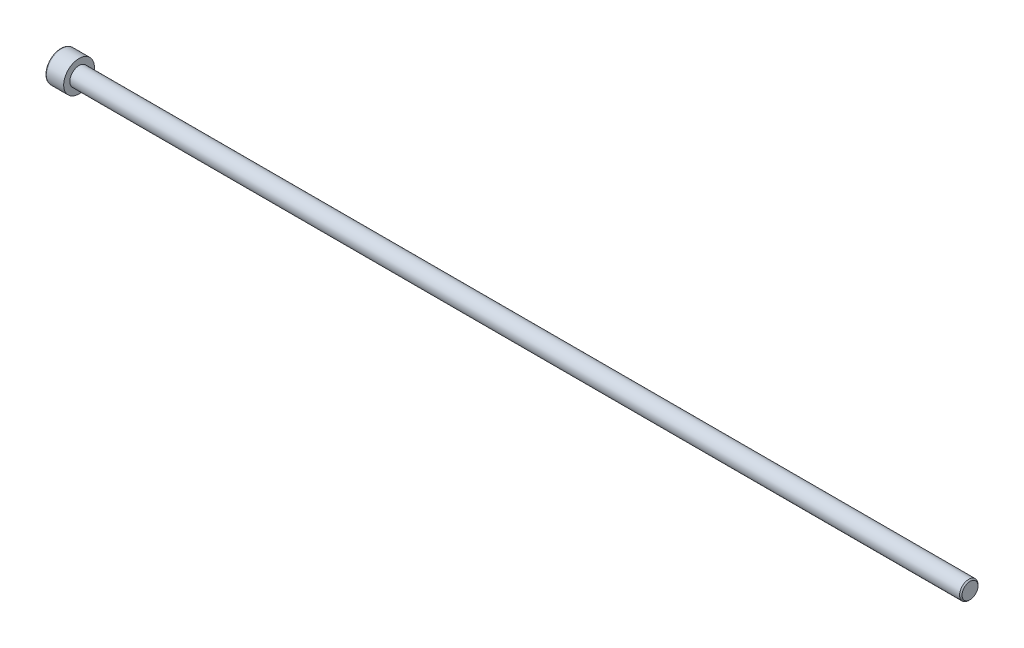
ISO-10303-21;
HEADER;
FILE_DESCRIPTION(('STEP AP214'),'2;1');
FILE_NAME('part.step','',(''),(''),'','','');
FILE_SCHEMA(('AUTOMOTIVE_DESIGN { 1 0 10303 214 1 1 1 1 }'));
ENDSEC;
DATA;
#1=APPLICATION_CONTEXT('core data for automotive mechanical design processes');
#2=APPLICATION_PROTOCOL_DEFINITION('international standard','automotive_design',2000,#1);
#3=PRODUCT_CONTEXT('',#1,'mechanical');
#4=PRODUCT('Part','Part','',(#3));
#5=PRODUCT_RELATED_PRODUCT_CATEGORY('part','',(#4));
#6=PRODUCT_DEFINITION_FORMATION('','',#4);
#7=PRODUCT_DEFINITION_CONTEXT('part definition',#1,'design');
#8=PRODUCT_DEFINITION('design','',#6,#7);
#9=PRODUCT_DEFINITION_SHAPE('','',#8);
#10=(LENGTH_UNIT() NAMED_UNIT(*) SI_UNIT(.MILLI.,.METRE.));
#11=(NAMED_UNIT(*) PLANE_ANGLE_UNIT() SI_UNIT($,.RADIAN.));
#12=(NAMED_UNIT(*) SI_UNIT($,.STERADIAN.) SOLID_ANGLE_UNIT());
#13=UNCERTAINTY_MEASURE_WITH_UNIT(LENGTH_MEASURE(1.E-05),#10,'distance_accuracy_value','');
#14=(GEOMETRIC_REPRESENTATION_CONTEXT(3) GLOBAL_UNCERTAINTY_ASSIGNED_CONTEXT((#13)) GLOBAL_UNIT_ASSIGNED_CONTEXT((#10,
#11,#12)) REPRESENTATION_CONTEXT('',''));
#15=CARTESIAN_POINT('',(0.,0.,0.));
#16=DIRECTION('',(0.,0.,1.));
#17=DIRECTION('',(1.,0.,0.));
#18=AXIS2_PLACEMENT_3D('',#15,#16,#17);
#19=CARTESIAN_POINT('',(0.,0.,0.));
#20=DIRECTION('',(1.,0.,0.));
#21=DIRECTION('',(0.,0.,-1.));
#22=AXIS2_PLACEMENT_3D('',#19,#20,#21);
#23=PLANE('',#22);
#24=CARTESIAN_POINT('',(0.,0.,0.));
#25=DIRECTION('',(1.,0.,0.));
#26=DIRECTION('',(0.,0.,-1.));
#27=AXIS2_PLACEMENT_3D('',#24,#25,#26);
#28=CIRCLE('',#27,5.);
#29=CARTESIAN_POINT('',(0.,0.,-5.));
#30=VERTEX_POINT('',#29);
#31=EDGE_CURVE('E225',#30,#30,#28,.T.);
#32=ORIENTED_EDGE('',*,*,#31,.T.);
#33=EDGE_LOOP('',(#32));
#34=FACE_BOUND('',#33,.T.);
#35=CARTESIAN_POINT('',(0.,0.,0.));
#36=DIRECTION('',(1.,0.,0.));
#37=DIRECTION('',(0.,0.,-1.));
#38=AXIS2_PLACEMENT_3D('',#35,#36,#37);
#39=CIRCLE('',#38,3.);
#40=CARTESIAN_POINT('',(0.,0.,-3.));
#41=VERTEX_POINT('',#40);
#42=EDGE_CURVE('E222',#41,#41,#39,.T.);
#43=ORIENTED_EDGE('',*,*,#42,.F.);
#44=EDGE_LOOP('',(#43));
#45=FACE_BOUND('',#44,.T.);
#46=ADVANCED_FACE('F17',(#34,#45),#23,.T.);
#47=CARTESIAN_POINT('',(-6.,0.,0.));
#48=DIRECTION('',(1.,0.,0.));
#49=DIRECTION('',(0.,0.,-1.));
#50=AXIS2_PLACEMENT_3D('',#47,#48,#49);
#51=CYLINDRICAL_SURFACE('',#50,5.);
#52=CARTESIAN_POINT('',(-5.6,0.,0.));
#53=DIRECTION('',(1.,0.,0.));
#54=DIRECTION('',(0.,0.,-1.));
#55=AXIS2_PLACEMENT_3D('',#52,#53,#54);
#56=CIRCLE('',#55,5.);
#57=CARTESIAN_POINT('',(-5.6,0.,-5.));
#58=VERTEX_POINT('',#57);
#59=EDGE_CURVE('E233',#58,#58,#56,.T.);
#60=ORIENTED_EDGE('',*,*,#59,.T.);
#61=EDGE_LOOP('',(#60));
#62=FACE_BOUND('',#61,.T.);
#63=ORIENTED_EDGE('',*,*,#31,.F.);
#64=EDGE_LOOP('',(#63));
#65=FACE_BOUND('',#64,.T.);
#66=ADVANCED_FACE('F19',(#62,#65),#51,.T.);
#67=CARTESIAN_POINT('',(-6.,0.,0.));
#68=DIRECTION('',(1.,0.,0.));
#69=DIRECTION('',(0.,0.,-1.));
#70=AXIS2_PLACEMENT_3D('',#67,#68,#69);
#71=PLANE('',#70);
#72=CARTESIAN_POINT('',(-6.,0.,0.));
#73=DIRECTION('',(1.,0.,0.));
#74=DIRECTION('',(0.,0.,-1.));
#75=AXIS2_PLACEMENT_3D('',#72,#73,#74);
#76=CIRCLE('',#75,4.6);
#77=CARTESIAN_POINT('',(-6.,0.,-4.6));
#78=VERTEX_POINT('',#77);
#79=EDGE_CURVE('E30',#78,#78,#76,.F.);
#80=ORIENTED_EDGE('',*,*,#79,.T.);
#81=EDGE_LOOP('',(#80));
#82=FACE_BOUND('',#81,.T.);
#83=CARTESIAN_POINT('',(-6.,0.,0.));
#84=DIRECTION('',(-1.,0.,0.));
#85=DIRECTION('',(0.,0.,1.));
#86=AXIS2_PLACEMENT_3D('',#83,#84,#85);
#87=CIRCLE('',#86,2.88675134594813);
#88=CARTESIAN_POINT('',(-6.,1.44337567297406,-2.5));
#89=VERTEX_POINT('',#88);
#90=CARTESIAN_POINT('',(-6.,-1.44337567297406,-2.5));
#91=VERTEX_POINT('',#90);
#92=EDGE_CURVE('E186',#89,#91,#87,.T.);
#93=ORIENTED_EDGE('',*,*,#92,.F.);
#94=CARTESIAN_POINT('',(-6.,2.88675134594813,0.));
#95=VERTEX_POINT('',#94);
#96=EDGE_CURVE('E91',#95,#89,#87,.T.);
#97=ORIENTED_EDGE('',*,*,#96,.F.);
#98=CARTESIAN_POINT('',(-6.,1.44337567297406,2.5));
#99=VERTEX_POINT('',#98);
#100=EDGE_CURVE('E36',#99,#95,#87,.T.);
#101=ORIENTED_EDGE('',*,*,#100,.F.);
#102=CARTESIAN_POINT('',(-6.,-1.44337567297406,2.5));
#103=VERTEX_POINT('',#102);
#104=EDGE_CURVE('E43',#103,#99,#87,.T.);
#105=ORIENTED_EDGE('',*,*,#104,.F.);
#106=CARTESIAN_POINT('',(-6.,-2.88675134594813,0.));
#107=VERTEX_POINT('',#106);
#108=EDGE_CURVE('E87',#107,#103,#87,.T.);
#109=ORIENTED_EDGE('',*,*,#108,.F.);
#110=EDGE_CURVE('E189',#91,#107,#87,.T.);
#111=ORIENTED_EDGE('',*,*,#110,.F.);
#112=EDGE_LOOP('',(#93,#97,#101,#105,#109,#111));
#113=FACE_BOUND('',#112,.T.);
#114=ADVANCED_FACE('F165',(#82,#113),#71,.F.);
#115=CARTESIAN_POINT('',(290.,0.,0.));
#116=DIRECTION('',(-1.,0.,0.));
#117=DIRECTION('',(0.,0.,1.));
#118=AXIS2_PLACEMENT_3D('',#115,#116,#117);
#119=CYLINDRICAL_SURFACE('',#118,3.);
#120=CARTESIAN_POINT('',(289.6,0.,0.));
#121=DIRECTION('',(1.,0.,0.));
#122=DIRECTION('',(0.,0.,-1.));
#123=AXIS2_PLACEMENT_3D('',#120,#121,#122);
#124=CIRCLE('',#123,3.);
#125=CARTESIAN_POINT('',(289.6,0.,-3.));
#126=VERTEX_POINT('',#125);
#127=EDGE_CURVE('E230',#126,#126,#124,.F.);
#128=ORIENTED_EDGE('',*,*,#127,.T.);
#129=EDGE_LOOP('',(#128));
#130=FACE_BOUND('',#129,.T.);
#131=ORIENTED_EDGE('',*,*,#42,.T.);
#132=EDGE_LOOP('',(#131));
#133=FACE_BOUND('',#132,.T.);
#134=ADVANCED_FACE('F170',(#130,#133),#119,.T.);
#135=CARTESIAN_POINT('',(290.,0.,0.));
#136=DIRECTION('',(1.,0.,0.));
#137=DIRECTION('',(0.,0.,-1.));
#138=AXIS2_PLACEMENT_3D('',#135,#136,#137);
#139=PLANE('',#138);
#140=CARTESIAN_POINT('',(290.,0.,0.));
#141=DIRECTION('',(1.,0.,0.));
#142=DIRECTION('',(0.,0.,-1.));
#143=AXIS2_PLACEMENT_3D('',#140,#141,#142);
#144=CIRCLE('',#143,2.6);
#145=CARTESIAN_POINT('',(290.,0.,-2.6));
#146=VERTEX_POINT('',#145);
#147=EDGE_CURVE('E227',#146,#146,#144,.T.);
#148=ORIENTED_EDGE('',*,*,#147,.T.);
#149=EDGE_LOOP('',(#148));
#150=FACE_BOUND('',#149,.T.);
#151=ADVANCED_FACE('F177',(#150),#139,.T.);
#152=CARTESIAN_POINT('',(290.,0.,0.));
#153=DIRECTION('',(-1.,0.,0.));
#154=DIRECTION('',(0.,0.,1.));
#155=AXIS2_PLACEMENT_3D('',#152,#153,#154);
#156=CONICAL_SURFACE('',#155,2.6,0.785398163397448);
#157=ORIENTED_EDGE('',*,*,#127,.F.);
#158=EDGE_LOOP('',(#157));
#159=FACE_BOUND('',#158,.T.);
#160=ORIENTED_EDGE('',*,*,#147,.F.);
#161=EDGE_LOOP('',(#160));
#162=FACE_BOUND('',#161,.T.);
#163=ADVANCED_FACE('F239',(#159,#162),#156,.T.);
#164=CARTESIAN_POINT('',(-5.6,0.,0.));
#165=DIRECTION('',(1.,0.,0.));
#166=DIRECTION('',(0.,0.,-1.));
#167=AXIS2_PLACEMENT_3D('',#164,#165,#166);
#168=TOROIDAL_SURFACE('',#167,4.6,0.4);
#169=ORIENTED_EDGE('',*,*,#79,.F.);
#170=EDGE_LOOP('',(#169));
#171=FACE_BOUND('',#170,.T.);
#172=ORIENTED_EDGE('',*,*,#59,.F.);
#173=EDGE_LOOP('',(#172));
#174=FACE_BOUND('',#173,.T.);
#175=ADVANCED_FACE('F115',(#171,#174),#168,.T.);
#176=CARTESIAN_POINT('',(-6.,0.,0.));
#177=DIRECTION('',(-1.,0.,0.));
#178=DIRECTION('',(0.,0.,1.));
#179=AXIS2_PLACEMENT_3D('',#176,#177,#178);
#180=CONICAL_SURFACE('',#179,2.88675134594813,0.785398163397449);
#181=ORIENTED_EDGE('',*,*,#92,.T.);
#182=CARTESIAN_POINT('',(-6.84474007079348,-2.77020363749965,-2.5));
#183=CARTESIAN_POINT('',(-6.79429722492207,-2.70224105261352,-2.5));
#184=CARTESIAN_POINT('',(-6.74437428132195,-2.63388631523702,-2.5));
#185=CARTESIAN_POINT('',(-6.6457965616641,-2.49624219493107,-2.5));
#186=CARTESIAN_POINT('',(-6.59714212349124,-2.42695257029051,-2.5));
#187=CARTESIAN_POINT('',(-6.50098521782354,-2.28678261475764,-2.5));
#188=CARTESIAN_POINT('',(-6.45349461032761,-2.21589411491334,-2.5));
#189=CARTESIAN_POINT('',(-6.36039504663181,-2.07289801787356,-2.5));
#190=CARTESIAN_POINT('',(-6.31478595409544,-2.00079050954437,-2.5));
#191=CARTESIAN_POINT('',(-6.22353453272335,-1.85136748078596,-2.5));
#192=CARTESIAN_POINT('',(-6.17801448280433,-1.77397645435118,-2.5));
#193=CARTESIAN_POINT('',(-6.09013743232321,-1.61742301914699,-2.5));
#194=CARTESIAN_POINT('',(-6.04778097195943,-1.53826031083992,-2.5));
#195=CARTESIAN_POINT('',(-5.92683684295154,-1.29823189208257,-2.5));
#196=CARTESIAN_POINT('',(-5.85401661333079,-1.1342610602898,-2.5));
#197=CARTESIAN_POINT('',(-5.76496495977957,-0.887111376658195,-2.5));
#198=CARTESIAN_POINT('',(-5.73923498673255,-0.807344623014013,-2.5));
#199=CARTESIAN_POINT('',(-5.69419468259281,-0.645977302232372,-2.5));
#200=CARTESIAN_POINT('',(-5.67488482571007,-0.564376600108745,-2.5));
#201=CARTESIAN_POINT('',(-5.64398238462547,-0.401145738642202,-2.5));
#202=CARTESIAN_POINT('',(-5.63226395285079,-0.319539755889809,-2.5));
#203=CARTESIAN_POINT('',(-5.61675591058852,-0.155573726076,-2.5));
#204=CARTESIAN_POINT('',(-5.61296514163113,-0.0732137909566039,-2.5));
#205=CARTESIAN_POINT('',(-5.61355627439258,0.0889406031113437,-2.5));
#206=CARTESIAN_POINT('',(-5.61769048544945,0.168736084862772,-2.5));
#207=CARTESIAN_POINT('',(-5.63338028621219,0.327588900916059,-2.5));
#208=CARTESIAN_POINT('',(-5.64493662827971,0.40664615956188,-2.5));
#209=CARTESIAN_POINT('',(-5.67505484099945,0.564788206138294,-2.5));
#210=CARTESIAN_POINT('',(-5.69373233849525,0.643850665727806,-2.5));
#211=CARTESIAN_POINT('',(-5.73713308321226,0.800257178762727,-2.5));
#212=CARTESIAN_POINT('',(-5.76185569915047,0.877601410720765,-2.5));
#213=CARTESIAN_POINT('',(-5.8505231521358,1.12635295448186,-2.5));
#214=CARTESIAN_POINT('',(-5.92477831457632,1.29410071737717,-2.5));
#215=CARTESIAN_POINT('',(-6.04840793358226,1.53952732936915,-2.5));
#216=CARTESIAN_POINT('',(-6.09175812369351,1.62045951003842,-2.5));
#217=CARTESIAN_POINT('',(-6.18175198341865,1.78047621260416,-2.5));
#218=CARTESIAN_POINT('',(-6.22839504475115,1.85956107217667,-2.5));
#219=CARTESIAN_POINT('',(-6.32189053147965,2.0121708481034,-2.5));
#220=CARTESIAN_POINT('',(-6.36861450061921,2.0857753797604,-2.5));
#221=CARTESIAN_POINT('',(-6.46400118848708,2.23172390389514,-2.5));
#222=CARTESIAN_POINT('',(-6.51266405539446,2.3040677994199,-2.5));
#223=CARTESIAN_POINT('',(-6.61117183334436,2.44706675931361,-2.5));
#224=CARTESIAN_POINT('',(-6.66100374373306,2.51773081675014,-2.5));
#225=CARTESIAN_POINT('',(-6.76196495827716,2.65809767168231,-2.5));
#226=CARTESIAN_POINT('',(-6.81309390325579,2.72780072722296,-2.5));
#227=CARTESIAN_POINT('',(-6.86475257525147,2.79710237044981,-2.5));
#228=B_SPLINE_CURVE_WITH_KNOTS('',3,(#182,#183,#184,#185,#186,#187,#188,#189,#190,#191,#192,
#193,#194,#195,#196,#197,#198,#199,#200,#201,#202,#203,#204,#205,#206,#207,#208,#209,#210,#211,
#212,#213,#214,#215,#216,#217,#218,#219,#220,#221,#222,#223,#224,#225,#226,#227),.UNSPECIFIED.,
.F.,.F.,(4,2,2,2,2,2,2,2,2,2,2,2,2,2,2,2,2,2,2,2,2,2,4),(0.,0.253915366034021,0.507897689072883,
0.763849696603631,1.01978312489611,1.28906200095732,1.55838675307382,2.09503555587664,
2.34626885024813,2.59752069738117,2.84449291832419,3.09142904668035,3.33077296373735,
3.57014114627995,3.81357397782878,4.0569813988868,4.60559640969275,4.88100918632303,
5.15637121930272,5.41788736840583,5.67942354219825,5.93881039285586,6.19812618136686),.UNSPECIFIED.);
#229=EDGE_CURVE('E11',#89,#91,#228,.F.);
#230=ORIENTED_EDGE('',*,*,#229,.F.);
#231=EDGE_LOOP('',(#181,#230));
#232=FACE_BOUND('',#231,.T.);
#233=ADVANCED_FACE('F113',(#232),#180,.F.);
#234=ORIENTED_EDGE('',*,*,#110,.T.);
#235=CARTESIAN_POINT('',(-6.00011547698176,-1.44326020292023,-2.5002));
#236=CARTESIAN_POINT('',(-5.95054070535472,-1.49287669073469,-2.41426172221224));
#237=CARTESIAN_POINT('',(-5.9038774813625,-1.5433228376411,-2.32688643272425));
#238=CARTESIAN_POINT('',(-5.8184381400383,-1.64618811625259,-2.14871854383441));
#239=CARTESIAN_POINT('',(-5.779709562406,-1.6986170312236,-2.05790899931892));
#240=CARTESIAN_POINT('',(-5.71336670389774,-1.80433744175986,-1.87479587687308));
#241=CARTESIAN_POINT('',(-5.68558566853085,-1.85760201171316,-1.78253893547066));
#242=CARTESIAN_POINT('',(-5.64278317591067,-1.96530378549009,-1.59599399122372));
#243=CARTESIAN_POINT('',(-5.62772976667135,-2.01973769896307,-1.50171168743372));
#244=CARTESIAN_POINT('',(-5.61414772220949,-2.11355131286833,-1.33922174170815));
#245=CARTESIAN_POINT('',(-5.6121370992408,-2.15280980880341,-1.27122403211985));
#246=CARTESIAN_POINT('',(-5.61552411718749,-2.23126263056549,-1.13533975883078));
#247=CARTESIAN_POINT('',(-5.62092435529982,-2.27045692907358,-1.06745324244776));
#248=CARTESIAN_POINT('',(-5.63882578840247,-2.34847544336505,-0.932321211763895));
#249=CARTESIAN_POINT('',(-5.65133492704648,-2.38729919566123,-0.86507650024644));
#250=CARTESIAN_POINT('',(-5.68276750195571,-2.46427534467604,-0.731749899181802));
#251=CARTESIAN_POINT('',(-5.70169044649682,-2.50242779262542,-0.665667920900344));
#252=CARTESIAN_POINT('',(-5.75786736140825,-2.60015256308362,-0.496403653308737));
#253=CARTESIAN_POINT('',(-5.79935583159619,-2.65911894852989,-0.394270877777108));
#254=CARTESIAN_POINT('',(-5.86939404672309,-2.74582384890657,-0.244093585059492));
#255=CARTESIAN_POINT('',(-5.89400225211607,-2.77439698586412,-0.194603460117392));
#256=CARTESIAN_POINT('',(-5.94546188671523,-2.83101398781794,-0.0965399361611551));
#257=CARTESIAN_POINT('',(-5.97231193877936,-2.85905816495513,-0.0479659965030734));
#258=CARTESIAN_POINT('',(-6.00011547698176,-2.88686681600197,0.000200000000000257));
#259=B_SPLINE_CURVE_WITH_KNOTS('',3,(#235,#236,#237,#238,#239,#240,#241,#242,#243,#244,#245,
#246,#247,#248,#249,#250,#251,#252,#253,#254,#255,#256,#257,#258),.UNSPECIFIED.,.F.,.F.,(4,2,2,
2,2,2,2,2,2,2,2,4),(0.,0.333012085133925,0.667964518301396,0.997597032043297,1.32639954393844,
1.56169424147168,1.79707142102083,2.0327121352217,2.2683347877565,2.64260240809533,
2.82922877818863,3.01574133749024),.UNSPECIFIED.);
#260=EDGE_CURVE('E90',#91,#107,#259,.T.);
#261=ORIENTED_EDGE('',*,*,#260,.F.);
#262=EDGE_LOOP('',(#234,#261));
#263=FACE_BOUND('',#262,.T.);
#264=ADVANCED_FACE('F244',(#263),#180,.F.);
#265=ORIENTED_EDGE('',*,*,#108,.T.);
#266=CARTESIAN_POINT('',(-6.00011547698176,-2.88686681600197,-0.000199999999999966));
#267=CARTESIAN_POINT('',(-5.95054070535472,-2.83725032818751,0.0857382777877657));
#268=CARTESIAN_POINT('',(-5.9038774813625,-2.78680418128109,0.173113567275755));
#269=CARTESIAN_POINT('',(-5.8184381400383,-2.6839389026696,0.35128145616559));
#270=CARTESIAN_POINT('',(-5.779709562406,-2.6315099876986,0.442091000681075));
#271=CARTESIAN_POINT('',(-5.71336670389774,-2.52578957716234,0.62520412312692));
#272=CARTESIAN_POINT('',(-5.68558566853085,-2.47252500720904,0.717461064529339));
#273=CARTESIAN_POINT('',(-5.64278317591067,-2.3648232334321,0.904006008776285));
#274=CARTESIAN_POINT('',(-5.62772976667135,-2.31038931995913,0.998288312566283));
#275=CARTESIAN_POINT('',(-5.61414772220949,-2.21657570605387,1.16077825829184));
#276=CARTESIAN_POINT('',(-5.6121370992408,-2.17731721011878,1.22877596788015));
#277=CARTESIAN_POINT('',(-5.61552411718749,-2.0988643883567,1.36466024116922));
#278=CARTESIAN_POINT('',(-5.62092435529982,-2.05967008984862,1.43254675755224));
#279=CARTESIAN_POINT('',(-5.63882578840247,-1.98165157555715,1.5676787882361));
#280=CARTESIAN_POINT('',(-5.65133492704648,-1.94282782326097,1.63492349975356));
#281=CARTESIAN_POINT('',(-5.68276750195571,-1.86585167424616,1.7682501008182));
#282=CARTESIAN_POINT('',(-5.70169044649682,-1.82769922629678,1.83433207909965));
#283=CARTESIAN_POINT('',(-5.75786736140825,-1.72997445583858,2.00359634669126));
#284=CARTESIAN_POINT('',(-5.79935583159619,-1.67100807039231,2.10572912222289));
#285=CARTESIAN_POINT('',(-5.86939404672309,-1.58430317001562,2.25590641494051));
#286=CARTESIAN_POINT('',(-5.89400225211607,-1.55573003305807,2.30539653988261));
#287=CARTESIAN_POINT('',(-5.94546188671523,-1.49911303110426,2.40346006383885));
#288=CARTESIAN_POINT('',(-5.97231193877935,-1.47106885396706,2.45203400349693));
#289=CARTESIAN_POINT('',(-6.00011547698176,-1.44326020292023,2.5002));
#290=B_SPLINE_CURVE_WITH_KNOTS('',3,(#266,#267,#268,#269,#270,#271,#272,#273,#274,#275,#276,
#277,#278,#279,#280,#281,#282,#283,#284,#285,#286,#287,#288,#289),.UNSPECIFIED.,.F.,.F.,(4,2,2,
2,2,2,2,2,2,2,2,4),(0.,0.333012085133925,0.667964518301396,0.997597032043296,1.32639954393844,
1.56169424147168,1.79707142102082,2.0327121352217,2.2683347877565,2.64260240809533,
2.82922877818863,3.01574133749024),.UNSPECIFIED.);
#291=EDGE_CURVE('E98',#107,#103,#290,.T.);
#292=ORIENTED_EDGE('',*,*,#291,.F.);
#293=EDGE_LOOP('',(#265,#292));
#294=FACE_BOUND('',#293,.T.);
#295=ADVANCED_FACE('F195',(#294),#180,.F.);
#296=ORIENTED_EDGE('',*,*,#104,.T.);
#297=CARTESIAN_POINT('',(-6.84474007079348,-2.77020363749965,2.5));
#298=CARTESIAN_POINT('',(-6.79429722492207,-2.70224105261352,2.5));
#299=CARTESIAN_POINT('',(-6.74437428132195,-2.63388631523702,2.5));
#300=CARTESIAN_POINT('',(-6.6457965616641,-2.49624219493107,2.5));
#301=CARTESIAN_POINT('',(-6.59714212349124,-2.4269525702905,2.5));
#302=CARTESIAN_POINT('',(-6.50098521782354,-2.28678261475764,2.5));
#303=CARTESIAN_POINT('',(-6.45349461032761,-2.21589411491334,2.5));
#304=CARTESIAN_POINT('',(-6.36039504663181,-2.07289801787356,2.5));
#305=CARTESIAN_POINT('',(-6.31478595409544,-2.00079050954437,2.5));
#306=CARTESIAN_POINT('',(-6.22353453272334,-1.85136748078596,2.5));
#307=CARTESIAN_POINT('',(-6.17801448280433,-1.77397645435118,2.5));
#308=CARTESIAN_POINT('',(-6.09013743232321,-1.61742301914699,2.5));
#309=CARTESIAN_POINT('',(-6.04778097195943,-1.53826031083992,2.5));
#310=CARTESIAN_POINT('',(-5.92683684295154,-1.29823189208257,2.5));
#311=CARTESIAN_POINT('',(-5.85401661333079,-1.1342610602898,2.5));
#312=CARTESIAN_POINT('',(-5.76496495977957,-0.887111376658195,2.5));
#313=CARTESIAN_POINT('',(-5.73923498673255,-0.807344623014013,2.5));
#314=CARTESIAN_POINT('',(-5.69419468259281,-0.645977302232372,2.5));
#315=CARTESIAN_POINT('',(-5.67488482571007,-0.564376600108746,2.5));
#316=CARTESIAN_POINT('',(-5.64398238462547,-0.401145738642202,2.5));
#317=CARTESIAN_POINT('',(-5.63226395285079,-0.319539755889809,2.5));
#318=CARTESIAN_POINT('',(-5.61675591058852,-0.155573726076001,2.5));
#319=CARTESIAN_POINT('',(-5.61296514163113,-0.0732137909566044,2.5));
#320=CARTESIAN_POINT('',(-5.61355627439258,0.0889406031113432,2.5));
#321=CARTESIAN_POINT('',(-5.61769048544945,0.168736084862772,2.5));
#322=CARTESIAN_POINT('',(-5.63338028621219,0.327588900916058,2.5));
#323=CARTESIAN_POINT('',(-5.64493662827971,0.406646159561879,2.5));
#324=CARTESIAN_POINT('',(-5.67505484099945,0.564788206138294,2.5));
#325=CARTESIAN_POINT('',(-5.69373233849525,0.643850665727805,2.5));
#326=CARTESIAN_POINT('',(-5.73713308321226,0.800257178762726,2.5));
#327=CARTESIAN_POINT('',(-5.76185569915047,0.877601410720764,2.5));
#328=CARTESIAN_POINT('',(-5.8505231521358,1.12635295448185,2.5));
#329=CARTESIAN_POINT('',(-5.92477831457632,1.29410071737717,2.5));
#330=CARTESIAN_POINT('',(-6.04840793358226,1.53952732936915,2.5));
#331=CARTESIAN_POINT('',(-6.09175812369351,1.62045951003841,2.5));
#332=CARTESIAN_POINT('',(-6.18175198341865,1.78047621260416,2.5));
#333=CARTESIAN_POINT('',(-6.22839504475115,1.85956107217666,2.5));
#334=CARTESIAN_POINT('',(-6.32189053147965,2.01217084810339,2.5));
#335=CARTESIAN_POINT('',(-6.3686145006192,2.0857753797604,2.5));
#336=CARTESIAN_POINT('',(-6.46400118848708,2.23172390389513,2.5));
#337=CARTESIAN_POINT('',(-6.51266405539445,2.3040677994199,2.5));
#338=CARTESIAN_POINT('',(-6.61117183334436,2.44706675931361,2.5));
#339=CARTESIAN_POINT('',(-6.66100374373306,2.51773081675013,2.5));
#340=CARTESIAN_POINT('',(-6.76196495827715,2.6580976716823,2.5));
#341=CARTESIAN_POINT('',(-6.81309390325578,2.72780072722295,2.5));
#342=CARTESIAN_POINT('',(-6.86475257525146,2.79710237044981,2.5));
#343=B_SPLINE_CURVE_WITH_KNOTS('',3,(#297,#298,#299,#300,#301,#302,#303,#304,#305,#306,#307,
#308,#309,#310,#311,#312,#313,#314,#315,#316,#317,#318,#319,#320,#321,#322,#323,#324,#325,#326,
#327,#328,#329,#330,#331,#332,#333,#334,#335,#336,#337,#338,#339,#340,#341,#342),.UNSPECIFIED.,
.F.,.F.,(4,2,2,2,2,2,2,2,2,2,2,2,2,2,2,2,2,2,2,2,2,2,4),(0.,0.253915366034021,0.507897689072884,
0.763849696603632,1.01978312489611,1.28906200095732,1.55838675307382,2.09503555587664,
2.34626885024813,2.59752069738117,2.84449291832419,3.09142904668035,3.33077296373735,
3.57014114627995,3.81357397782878,4.0569813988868,4.60559640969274,4.88100918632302,
5.15637121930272,5.41788736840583,5.67942354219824,5.93881039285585,6.19812618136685),.UNSPECIFIED.);
#344=EDGE_CURVE('E123',#103,#99,#343,.T.);
#345=ORIENTED_EDGE('',*,*,#344,.F.);
#346=EDGE_LOOP('',(#296,#345));
#347=FACE_BOUND('',#346,.T.);
#348=ADVANCED_FACE('F198',(#347),#180,.F.);
#349=ORIENTED_EDGE('',*,*,#100,.T.);
#350=CARTESIAN_POINT('',(-6.00011547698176,1.44326020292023,2.5002));
#351=CARTESIAN_POINT('',(-5.95054070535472,1.49287669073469,2.41426172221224));
#352=CARTESIAN_POINT('',(-5.9038774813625,1.5433228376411,2.32688643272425));
#353=CARTESIAN_POINT('',(-5.8184381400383,1.64618811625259,2.14871854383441));
#354=CARTESIAN_POINT('',(-5.779709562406,1.6986170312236,2.05790899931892));
#355=CARTESIAN_POINT('',(-5.71336670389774,1.80433744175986,1.87479587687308));
#356=CARTESIAN_POINT('',(-5.68558566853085,1.85760201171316,1.78253893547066));
#357=CARTESIAN_POINT('',(-5.64278317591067,1.96530378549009,1.59599399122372));
#358=CARTESIAN_POINT('',(-5.62772976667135,2.01973769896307,1.50171168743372));
#359=CARTESIAN_POINT('',(-5.61414772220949,2.11355131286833,1.33922174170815));
#360=CARTESIAN_POINT('',(-5.6121370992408,2.15280980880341,1.27122403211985));
#361=CARTESIAN_POINT('',(-5.61552411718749,2.23126263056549,1.13533975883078));
#362=CARTESIAN_POINT('',(-5.62092435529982,2.27045692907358,1.06745324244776));
#363=CARTESIAN_POINT('',(-5.63882578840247,2.34847544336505,0.932321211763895));
#364=CARTESIAN_POINT('',(-5.65133492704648,2.38729919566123,0.86507650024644));
#365=CARTESIAN_POINT('',(-5.68276750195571,2.46427534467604,0.731749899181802));
#366=CARTESIAN_POINT('',(-5.70169044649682,2.50242779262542,0.665667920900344));
#367=CARTESIAN_POINT('',(-5.75786736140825,2.60015256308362,0.496403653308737));
#368=CARTESIAN_POINT('',(-5.79935583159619,2.65911894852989,0.394270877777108));
#369=CARTESIAN_POINT('',(-5.86939404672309,2.74582384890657,0.244093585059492));
#370=CARTESIAN_POINT('',(-5.89400225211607,2.77439698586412,0.194603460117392));
#371=CARTESIAN_POINT('',(-5.94546188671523,2.83101398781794,0.0965399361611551));
#372=CARTESIAN_POINT('',(-5.97231193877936,2.85905816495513,0.0479659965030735));
#373=CARTESIAN_POINT('',(-6.00011547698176,2.88686681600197,-0.000200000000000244));
#374=B_SPLINE_CURVE_WITH_KNOTS('',3,(#350,#351,#352,#353,#354,#355,#356,#357,#358,#359,#360,
#361,#362,#363,#364,#365,#366,#367,#368,#369,#370,#371,#372,#373),.UNSPECIFIED.,.F.,.F.,(4,2,2,
2,2,2,2,2,2,2,2,4),(0.,0.333012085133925,0.667964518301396,0.997597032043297,1.32639954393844,
1.56169424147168,1.79707142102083,2.0327121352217,2.2683347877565,2.64260240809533,
2.82922877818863,3.01574133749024),.UNSPECIFIED.);
#375=EDGE_CURVE('E129',#99,#95,#374,.T.);
#376=ORIENTED_EDGE('',*,*,#375,.F.);
#377=EDGE_LOOP('',(#349,#376));
#378=FACE_BOUND('',#377,.T.);
#379=ADVANCED_FACE('F111',(#378),#180,.F.);
#380=ORIENTED_EDGE('',*,*,#96,.T.);
#381=CARTESIAN_POINT('',(-6.00011547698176,2.88686681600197,0.00020000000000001));
#382=CARTESIAN_POINT('',(-5.95054070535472,2.83725032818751,-0.0857382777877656));
#383=CARTESIAN_POINT('',(-5.9038774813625,2.78680418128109,-0.173113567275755));
#384=CARTESIAN_POINT('',(-5.8184381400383,2.6839389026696,-0.35128145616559));
#385=CARTESIAN_POINT('',(-5.779709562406,2.6315099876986,-0.442091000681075));
#386=CARTESIAN_POINT('',(-5.71336670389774,2.52578957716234,-0.62520412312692));
#387=CARTESIAN_POINT('',(-5.68558566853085,2.47252500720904,-0.717461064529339));
#388=CARTESIAN_POINT('',(-5.64278317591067,2.3648232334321,-0.904006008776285));
#389=CARTESIAN_POINT('',(-5.62772976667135,2.31038931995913,-0.998288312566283));
#390=CARTESIAN_POINT('',(-5.61414772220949,2.21657570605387,-1.16077825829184));
#391=CARTESIAN_POINT('',(-5.6121370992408,2.17731721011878,-1.22877596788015));
#392=CARTESIAN_POINT('',(-5.61552411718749,2.0988643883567,-1.36466024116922));
#393=CARTESIAN_POINT('',(-5.62092435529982,2.05967008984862,-1.43254675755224));
#394=CARTESIAN_POINT('',(-5.63882578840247,1.98165157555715,-1.5676787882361));
#395=CARTESIAN_POINT('',(-5.65133492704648,1.94282782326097,-1.63492349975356));
#396=CARTESIAN_POINT('',(-5.68276750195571,1.86585167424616,-1.7682501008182));
#397=CARTESIAN_POINT('',(-5.70169044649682,1.82769922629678,-1.83433207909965));
#398=CARTESIAN_POINT('',(-5.75786736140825,1.72997445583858,-2.00359634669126));
#399=CARTESIAN_POINT('',(-5.79935583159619,1.67100807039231,-2.10572912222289));
#400=CARTESIAN_POINT('',(-5.86939404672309,1.58430317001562,-2.25590641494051));
#401=CARTESIAN_POINT('',(-5.89400225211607,1.55573003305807,-2.30539653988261));
#402=CARTESIAN_POINT('',(-5.94546188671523,1.49911303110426,-2.40346006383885));
#403=CARTESIAN_POINT('',(-5.97231193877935,1.47106885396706,-2.45203400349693));
#404=CARTESIAN_POINT('',(-6.00011547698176,1.44326020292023,-2.5002));
#405=B_SPLINE_CURVE_WITH_KNOTS('',3,(#381,#382,#383,#384,#385,#386,#387,#388,#389,#390,#391,
#392,#393,#394,#395,#396,#397,#398,#399,#400,#401,#402,#403,#404),.UNSPECIFIED.,.F.,.F.,(4,2,2,
2,2,2,2,2,2,2,2,4),(0.,0.333012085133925,0.667964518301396,0.997597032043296,1.32639954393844,
1.56169424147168,1.79707142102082,2.0327121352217,2.2683347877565,2.64260240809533,
2.82922877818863,3.01574133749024),.UNSPECIFIED.);
#406=EDGE_CURVE('E134',#95,#89,#405,.T.);
#407=ORIENTED_EDGE('',*,*,#406,.F.);
#408=EDGE_LOOP('',(#380,#407));
#409=FACE_BOUND('',#408,.T.);
#410=ADVANCED_FACE('F106',(#409),#180,.F.);
#411=CARTESIAN_POINT('',(-2.,-1.44337567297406,-2.5));
#412=DIRECTION('',(0.,0.,-1.));
#413=DIRECTION('',(-1.,0.,0.));
#414=AXIS2_PLACEMENT_3D('',#411,#412,#413);
#415=PLANE('',#414);
#416=DIRECTION('',(-1.,0.,0.));
#417=VECTOR('',#416,1.);
#418=CARTESIAN_POINT('',(-2.,1.44337567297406,-2.5));
#419=LINE('',#418,#417);
#420=CARTESIAN_POINT('',(-2.,1.44337567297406,-2.5));
#421=VERTEX_POINT('',#420);
#422=EDGE_CURVE('E219',#421,#89,#419,.T.);
#423=ORIENTED_EDGE('',*,*,#422,.T.);
#424=ORIENTED_EDGE('',*,*,#229,.T.);
#425=DIRECTION('',(-1.,0.,0.));
#426=VECTOR('',#425,1.);
#427=CARTESIAN_POINT('',(-2.,-1.44337567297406,-2.5));
#428=LINE('',#427,#426);
#429=CARTESIAN_POINT('',(-2.,-1.44337567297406,-2.5));
#430=VERTEX_POINT('',#429);
#431=EDGE_CURVE('E213',#430,#91,#428,.T.);
#432=ORIENTED_EDGE('',*,*,#431,.F.);
#433=DIRECTION('',(0.,-1.,0.));
#434=VECTOR('',#433,1.);
#435=CARTESIAN_POINT('',(-2.,-1.44337567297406,-2.5));
#436=LINE('',#435,#434);
#437=EDGE_CURVE('E267',#421,#430,#436,.T.);
#438=ORIENTED_EDGE('',*,*,#437,.F.);
#439=EDGE_LOOP('',(#423,#424,#432,#438));
#440=FACE_BOUND('',#439,.T.);
#441=ADVANCED_FACE('F110',(#440),#415,.F.);
#442=CARTESIAN_POINT('',(-2.,-2.88675134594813,0.));
#443=DIRECTION('',(0.,-0.866025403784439,-0.5));
#444=DIRECTION('',(0.,0.5,-0.866025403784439));
#445=AXIS2_PLACEMENT_3D('',#442,#443,#444);
#446=PLANE('',#445);
#447=ORIENTED_EDGE('',*,*,#431,.T.);
#448=ORIENTED_EDGE('',*,*,#260,.T.);
#449=DIRECTION('',(-1.,0.,0.));
#450=VECTOR('',#449,1.);
#451=CARTESIAN_POINT('',(-2.,-2.88675134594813,0.));
#452=LINE('',#451,#450);
#453=CARTESIAN_POINT('',(-2.,-2.88675134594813,0.));
#454=VERTEX_POINT('',#453);
#455=EDGE_CURVE('E207',#454,#107,#452,.T.);
#456=ORIENTED_EDGE('',*,*,#455,.F.);
#457=DIRECTION('',(0.,-0.5,0.866025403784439));
#458=VECTOR('',#457,1.);
#459=CARTESIAN_POINT('',(-2.,-2.88675134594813,0.));
#460=LINE('',#459,#458);
#461=EDGE_CURVE('E273',#430,#454,#460,.T.);
#462=ORIENTED_EDGE('',*,*,#461,.F.);
#463=EDGE_LOOP('',(#447,#448,#456,#462));
#464=FACE_BOUND('',#463,.T.);
#465=ADVANCED_FACE('F104',(#464),#446,.F.);
#466=CARTESIAN_POINT('',(-2.,-1.44337567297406,2.5));
#467=DIRECTION('',(0.,-0.866025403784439,0.5));
#468=DIRECTION('',(0.,-0.5,-0.866025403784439));
#469=AXIS2_PLACEMENT_3D('',#466,#467,#468);
#470=PLANE('',#469);
#471=ORIENTED_EDGE('',*,*,#455,.T.);
#472=ORIENTED_EDGE('',*,*,#291,.T.);
#473=DIRECTION('',(-1.,0.,0.));
#474=VECTOR('',#473,1.);
#475=CARTESIAN_POINT('',(-2.,-1.44337567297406,2.5));
#476=LINE('',#475,#474);
#477=CARTESIAN_POINT('',(-2.,-1.44337567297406,2.5));
#478=VERTEX_POINT('',#477);
#479=EDGE_CURVE('E204',#478,#103,#476,.T.);
#480=ORIENTED_EDGE('',*,*,#479,.F.);
#481=DIRECTION('',(0.,0.5,0.866025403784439));
#482=VECTOR('',#481,1.);
#483=CARTESIAN_POINT('',(-2.,-1.44337567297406,2.5));
#484=LINE('',#483,#482);
#485=EDGE_CURVE('E277',#454,#478,#484,.T.);
#486=ORIENTED_EDGE('',*,*,#485,.F.);
#487=EDGE_LOOP('',(#471,#472,#480,#486));
#488=FACE_BOUND('',#487,.T.);
#489=ADVANCED_FACE('F148',(#488),#470,.F.);
#490=CARTESIAN_POINT('',(-2.,1.44337567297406,2.5));
#491=DIRECTION('',(0.,0.,1.));
#492=DIRECTION('',(1.,0.,0.));
#493=AXIS2_PLACEMENT_3D('',#490,#491,#492);
#494=PLANE('',#493);
#495=ORIENTED_EDGE('',*,*,#479,.T.);
#496=ORIENTED_EDGE('',*,*,#344,.T.);
#497=DIRECTION('',(-1.,0.,0.));
#498=VECTOR('',#497,1.);
#499=CARTESIAN_POINT('',(-2.,1.44337567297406,2.5));
#500=LINE('',#499,#498);
#501=CARTESIAN_POINT('',(-2.,1.44337567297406,2.5));
#502=VERTEX_POINT('',#501);
#503=EDGE_CURVE('E209',#502,#99,#500,.T.);
#504=ORIENTED_EDGE('',*,*,#503,.F.);
#505=DIRECTION('',(0.,1.,0.));
#506=VECTOR('',#505,1.);
#507=CARTESIAN_POINT('',(-2.,1.44337567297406,2.5));
#508=LINE('',#507,#506);
#509=EDGE_CURVE('E208',#478,#502,#508,.T.);
#510=ORIENTED_EDGE('',*,*,#509,.F.);
#511=EDGE_LOOP('',(#495,#496,#504,#510));
#512=FACE_BOUND('',#511,.T.);
#513=ADVANCED_FACE('F144',(#512),#494,.F.);
#514=CARTESIAN_POINT('',(-2.,2.88675134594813,0.));
#515=DIRECTION('',(0.,0.866025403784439,0.5));
#516=DIRECTION('',(0.,-0.5,0.866025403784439));
#517=AXIS2_PLACEMENT_3D('',#514,#515,#516);
#518=PLANE('',#517);
#519=ORIENTED_EDGE('',*,*,#503,.T.);
#520=ORIENTED_EDGE('',*,*,#375,.T.);
#521=DIRECTION('',(-1.,0.,0.));
#522=VECTOR('',#521,1.);
#523=CARTESIAN_POINT('',(-2.,2.88675134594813,0.));
#524=LINE('',#523,#522);
#525=CARTESIAN_POINT('',(-2.,2.88675134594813,0.));
#526=VERTEX_POINT('',#525);
#527=EDGE_CURVE('E211',#526,#95,#524,.T.);
#528=ORIENTED_EDGE('',*,*,#527,.F.);
#529=DIRECTION('',(0.,0.5,-0.866025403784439));
#530=VECTOR('',#529,1.);
#531=CARTESIAN_POINT('',(-2.,2.88675134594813,0.));
#532=LINE('',#531,#530);
#533=EDGE_CURVE('E221',#502,#526,#532,.T.);
#534=ORIENTED_EDGE('',*,*,#533,.F.);
#535=EDGE_LOOP('',(#519,#520,#528,#534));
#536=FACE_BOUND('',#535,.T.);
#537=ADVANCED_FACE('F140',(#536),#518,.F.);
#538=CARTESIAN_POINT('',(-2.,1.44337567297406,-2.5));
#539=DIRECTION('',(0.,0.866025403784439,-0.5));
#540=DIRECTION('',(0.,0.5,0.866025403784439));
#541=AXIS2_PLACEMENT_3D('',#538,#539,#540);
#542=PLANE('',#541);
#543=ORIENTED_EDGE('',*,*,#527,.T.);
#544=ORIENTED_EDGE('',*,*,#406,.T.);
#545=ORIENTED_EDGE('',*,*,#422,.F.);
#546=DIRECTION('',(0.,-0.5,-0.866025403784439));
#547=VECTOR('',#546,1.);
#548=CARTESIAN_POINT('',(-2.,1.44337567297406,-2.5));
#549=LINE('',#548,#547);
#550=EDGE_CURVE('E271',#526,#421,#549,.T.);
#551=ORIENTED_EDGE('',*,*,#550,.F.);
#552=EDGE_LOOP('',(#543,#544,#545,#551));
#553=FACE_BOUND('',#552,.T.);
#554=ADVANCED_FACE('F143',(#553),#542,.F.);
#555=CARTESIAN_POINT('',(-2.,0.,0.));
#556=DIRECTION('',(-1.,0.,0.));
#557=DIRECTION('',(0.,0.,1.));
#558=AXIS2_PLACEMENT_3D('',#555,#556,#557);
#559=PLANE('',#558);
#560=CARTESIAN_POINT('',(-2.,0.,0.));
#561=DIRECTION('',(-1.,0.,0.));
#562=DIRECTION('',(0.,0.,1.));
#563=AXIS2_PLACEMENT_3D('',#560,#561,#562);
#564=CIRCLE('',#563,3.);
#565=CARTESIAN_POINT('',(-2.,0.,3.));
#566=VERTEX_POINT('',#565);
#567=EDGE_CURVE('E84',#566,#566,#564,.T.);
#568=ORIENTED_EDGE('',*,*,#567,.F.);
#569=EDGE_LOOP('',(#568));
#570=FACE_BOUND('',#569,.T.);
#571=ORIENTED_EDGE('',*,*,#461,.T.);
#572=ORIENTED_EDGE('',*,*,#485,.T.);
#573=ORIENTED_EDGE('',*,*,#509,.T.);
#574=ORIENTED_EDGE('',*,*,#533,.T.);
#575=ORIENTED_EDGE('',*,*,#550,.T.);
#576=ORIENTED_EDGE('',*,*,#437,.T.);
#577=EDGE_LOOP('',(#571,#572,#573,#574,#575,#576));
#578=FACE_BOUND('',#577,.T.);
#579=ADVANCED_FACE('F80',(#570,#578),#559,.F.);
#580=CARTESIAN_POINT('',(-2.,0.,0.));
#581=DIRECTION('',(-1.,0.,0.));
#582=DIRECTION('',(0.,0.,1.));
#583=AXIS2_PLACEMENT_3D('',#580,#581,#582);
#584=CONICAL_SURFACE('',#583,3.,1.0471975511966);
#585=CARTESIAN_POINT('',(-0.267949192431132,0.,0.));
#586=VERTEX_POINT('',#585);
#587=VERTEX_LOOP('',#586);
#588=FACE_BOUND('',#587,.T.);
#589=ORIENTED_EDGE('',*,*,#567,.T.);
#590=EDGE_LOOP('',(#589));
#591=FACE_BOUND('',#590,.T.);
#592=ADVANCED_FACE('F77',(#588,#591),#584,.F.);
#593=CLOSED_SHELL('',(#46,#66,#114,#134,#151,#163,#175,#233,#264,#295,#348,#379,#410,#441,#465,
#489,#513,#537,#554,#579,#592));
#594=MANIFOLD_SOLID_BREP('B1',#593);
#595=ADVANCED_BREP_SHAPE_REPRESENTATION('',(#18,#594),#14);
#596=SHAPE_DEFINITION_REPRESENTATION(#9,#595);
ENDSEC;
END-ISO-10303-21;
